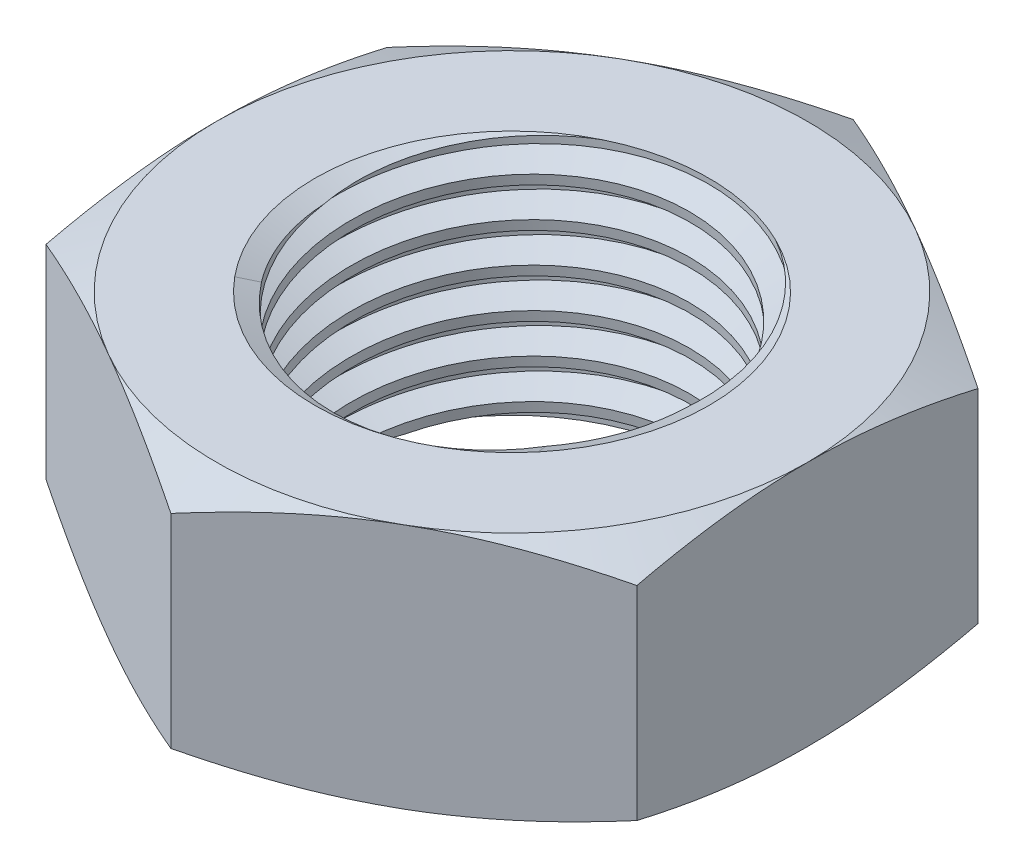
from build123d import *

# Parameters (mm, degrees)
EXTRUDE1_DEPTH      = 7.9375
SKETCH2_W           = 6.35
SKETCH2_H           = 7.9375
LPATTERN1_COUNT     = 6
LPATTERN1_PITCH     = 1.27
LPATTERN1_COL_COUNT = 2
LPATTERN1_COL_PITCH = 1.27


with BuildPart() as part:
    # Sketch1 → Extrude1 (new body)
    with BuildSketch(Plane(origin=(0, 0, 0), x_dir=(1, 0, 0), z_dir=(0, 1, 0))):
        Polygon((0, 10.998522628), (-9.525, 5.499261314), (-9.525, -5.499261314), (0, -10.998522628), (9.525, -5.499261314), (9.525, 5.499261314), align=None)
    extrude(amount=EXTRUDE1_DEPTH)

    # Sketch4 → Cut-Revolve2 (revolve, cut)
    with BuildSketch(Plane(origin=(0, 0, 0), x_dir=(0, 0, -1), z_dir=(1, 0, 0)), mode=Mode.PRIVATE) as cut_revolve2_sk:
        Polygon((0, 7.9375), (6.35, 7.9375), (5.721290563, 7.644327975), (5.721290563, 0.293172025), (6.35, 0), (0, 0), align=None)
    revolve(cut_revolve2_sk.sketch.rotate(Axis((0, 7.9375, 0), (0, 1, 0)), 54.6652943), axis=Axis((0, 7.9375, 0), (0, 1, 0)), mode=Mode.SUBTRACT)


with BuildPart() as body_2:
    # Sketch2 → Revolve1 (revolve)
    with BuildSketch(Plane(origin=(0, 0, 0), x_dir=(0, 0, -1), z_dir=(1, 0, 0))):
        with Locations((3.175, 3.96875)):
            Rectangle(SKETCH2_W, SKETCH2_H)
    revolve(axis=Axis((0, -6.35, 0), (0, 1, 0)))

    # Sketch3 → Cut-Revolve1 (revolve, cut)
    with BuildSketch(Plane(origin=(0, 0, 0), x_dir=(0, 0, -1), z_dir=(1, 0, 0)), mode=Mode.PRIVATE) as cut_revolve1_sk:
        Polygon((6.365796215, 7.779537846), (6.476369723, 6.673802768), (5.752882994, 7.000308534), (5.721290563, 7.316232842), align=None)
    cut_revolve1 = revolve(cut_revolve1_sk.sketch.rotate(Axis((0, 7.9375, 0.135293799), (0, -0.9950371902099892, -0.09950371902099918)), 180), axis=Axis((0, 7.9375, 0.135293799), (0, -0.9950371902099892, -0.09950371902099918)), mode=Mode.SUBTRACT)

    # LPattern1: Cut-Revolve1 ×6
    with Locations(*[(0, -i * LPATTERN1_PITCH, 0) for i in range(1, LPATTERN1_COUNT)]):
        add(cut_revolve1, mode=Mode.SUBTRACT)

    # LPattern1 col: Cut-Revolve1 ×2
    with Locations(*[(0, i * LPATTERN1_COL_PITCH, 0) for i in range(1, LPATTERN1_COL_COUNT)]):
        add(cut_revolve1, mode=Mode.SUBTRACT)


with BuildPart() as part_1:
    add(part.part)

    # Combine1: cut body 2
    add(body_2.part, mode=Mode.SUBTRACT)

    # Sketch5 → Cut-Revolve3 (revolve, cut)
    with BuildSketch(Plane(origin=(0, 0, 0), x_dir=(0, 0, -1), z_dir=(1, 0, 0)), mode=Mode.PRIVATE) as cut_revolve3_sk:
        Polygon((0, 0), (9.525, 0), (10.998522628, 0.687114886), (10.998522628, 7.250385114), (9.525, 7.9375), (0, 7.9375), (0, 9.2075), (12.268522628, 9.2075), (12.268522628, -1.27), (0, -1.27), align=None)
    revolve(cut_revolve3_sk.sketch.rotate(Axis((0, 0, 0), (0, 1, 0)), 54.6652943), axis=Axis((0, 0, 0), (0, 1, 0)), mode=Mode.SUBTRACT)


solid = part_1.part
